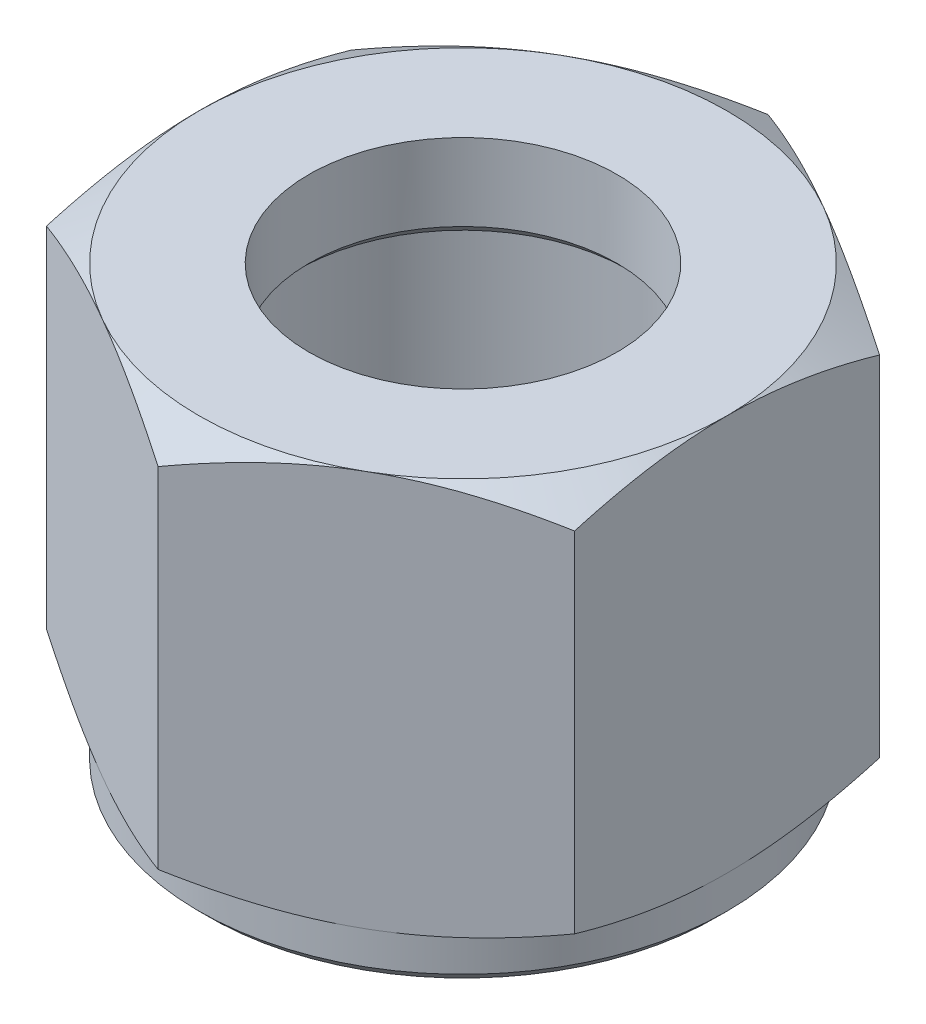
from build123d import *

# Parameters (mm, degrees)
P_IDAT_VYSUNUT_M1_DEPTH  = 18
SKICA2_OUTSIDE_W         = 96.522
SKICA2_OUTSIDE_H         = 100.234
SKICA2_OUTSIDE_R         = 12
ODEBRAT_VYSUNUT_M1_DEPTH = 18
ODEBRAT_VYSUNUT_M1_DRAFT = -60
SKICA3_OUTSIDE_W         = 96.522
SKICA3_OUTSIDE_H         = 100.234
SKICA3_OUTSIDE_R         = 12
ODEBRAT_VYSUNUT_M2_DEPTH = 18
ODEBRAT_VYSUNUT_M2_DRAFT = -60
SKICA4_R                 = 12
P_IDAT_VYSUNUT_M2_DEPTH  = 2
ZKOSEN_1_SIZE            = 0.5
SKICA5_R                 = 9
ODEBRAT_VYSUNUT_M3_DEPTH = 16
ZKOSEN_2_SIZE            = 0.35
SKICA6_R                 = 7
ODEBRAT_VYSUNUT_M4_DEPTH = 4
ZKOSEN_3_SIZE            = 0.5


with BuildPart() as part:
    # Skica1 → P_idat vysunut_m1 (new body)
    with BuildSketch(Plane(origin=(0, 0, 0), x_dir=(1, 0, 0), z_dir=(0, 1, 0))):
        Polygon((0, 13.856406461), (-12, 6.92820323), (-12, -6.92820323), (0, -13.856406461), (12, -6.92820323), (12, 6.92820323), align=None)
    extrude(amount=P_IDAT_VYSUNUT_M1_DEPTH)


with BuildPart() as odebrat_vysunut_m1_tool:
    # Skica2 outside → Odebrat vysunut_m1 (with draft: the straight prism first)
    with BuildSketch(Plane(origin=(0, 18, 0), x_dir=(-1, 0, 0), z_dir=(0, 1, 0))):
        Rectangle(SKICA2_OUTSIDE_W, SKICA2_OUTSIDE_H)
        Circle(SKICA2_OUTSIDE_R, mode=Mode.SUBTRACT)
    extrude(amount=-ODEBRAT_VYSUNUT_M1_DEPTH)
    # Odebrat vysunut_m1: the draft: its side faces are tilted about the plane it starts from
    odebrat_vysunut_m1_sides = [odebrat_vysunut_m1_tool.faces().sort_by_distance(p)[0] for p in [
        (0, 9, -50.117),
        (-48.261, 9, 0),
        (0, 9, 50.117),
        (48.261, 9, 0),
        (12, 9, 0),
    ]]
    draft(odebrat_vysunut_m1_sides, Plane(origin=(0, 18, 0), x_dir=(-1, 0, 0), z_dir=(0, 1, 0)), ODEBRAT_VYSUNUT_M1_DRAFT)


with BuildPart() as part_1:
    add(part.part)

    # Odebrat vysunut_m1: cut by odebrat_vysunut_m1_tool
    add(odebrat_vysunut_m1_tool.part, mode=Mode.SUBTRACT)


with BuildPart() as odebrat_vysunut_m2_tool:
    # Skica3 outside → Odebrat vysunut_m2 (with draft: the straight prism first)
    with BuildSketch(Plane.XZ):
        Rectangle(SKICA3_OUTSIDE_W, SKICA3_OUTSIDE_H)
        Circle(SKICA3_OUTSIDE_R, mode=Mode.SUBTRACT)
    extrude(amount=-ODEBRAT_VYSUNUT_M2_DEPTH)
    # Odebrat vysunut_m2: the draft: its side faces are tilted about the plane it starts from
    odebrat_vysunut_m2_sides = [odebrat_vysunut_m2_tool.faces().sort_by_distance(p)[0] for p in [
        (0, 9, -50.117),
        (48.261, 9, 0),
        (0, 9, 50.117),
        (-48.261, 9, 0),
        (-12, 9, 0),
    ]]
    draft(odebrat_vysunut_m2_sides, Plane.XZ, ODEBRAT_VYSUNUT_M2_DRAFT)


with BuildPart() as part_2:
    add(part_1.part)

    # Odebrat vysunut_m2: cut by odebrat_vysunut_m2_tool
    add(odebrat_vysunut_m2_tool.part, mode=Mode.SUBTRACT)

    # Skica4 → P_idat vysunut_m2 (add)
    with BuildSketch(Plane.XZ):
        with Locations(Location((0, 0, 0), (0, 0, 60))):
            Circle(SKICA4_R)
    extrude(amount=P_IDAT_VYSUNUT_M2_DEPTH)

    # Zkosen_1
    zkosen_1_edges = [part_2.edges().sort_by_distance(p)[0] for p in [
        (-6, -2, -10.392304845),
    ]]
    chamfer(zkosen_1_edges, length=ZKOSEN_1_SIZE)

    # Skica5 → Odebrat vysunut_m3 (cut)
    with BuildSketch(Plane.XZ.offset(2)):
        with Locations(Location((0, 0, 0), (0, 0, 270))):
            Circle(SKICA5_R)
    extrude(amount=-ODEBRAT_VYSUNUT_M3_DEPTH, mode=Mode.SUBTRACT)

    # Zkosen_2
    zkosen_2_edges = [part_2.edges().sort_by_distance(p)[0] for p in [
        (0, -2, 9),
    ]]
    chamfer(zkosen_2_edges, length=ZKOSEN_2_SIZE)

    # Skica6 → Odebrat vysunut_m4 (cut)
    with BuildSketch(Plane(origin=(0, 18, 0), x_dir=(1, 0, 0), z_dir=(0, 1, 0))):
        with Locations(Location((0, 0, 0), (0, 0, 270))):
            Circle(SKICA6_R)
    extrude(amount=-ODEBRAT_VYSUNUT_M4_DEPTH, mode=Mode.SUBTRACT)

    # Zkosen_3
    zkosen_3_edges = [part_2.edges().sort_by_distance(p)[0] for p in [
        (0, 14, -7),
    ]]
    chamfer(zkosen_3_edges, length=ZKOSEN_3_SIZE)


solid = part_2.part
